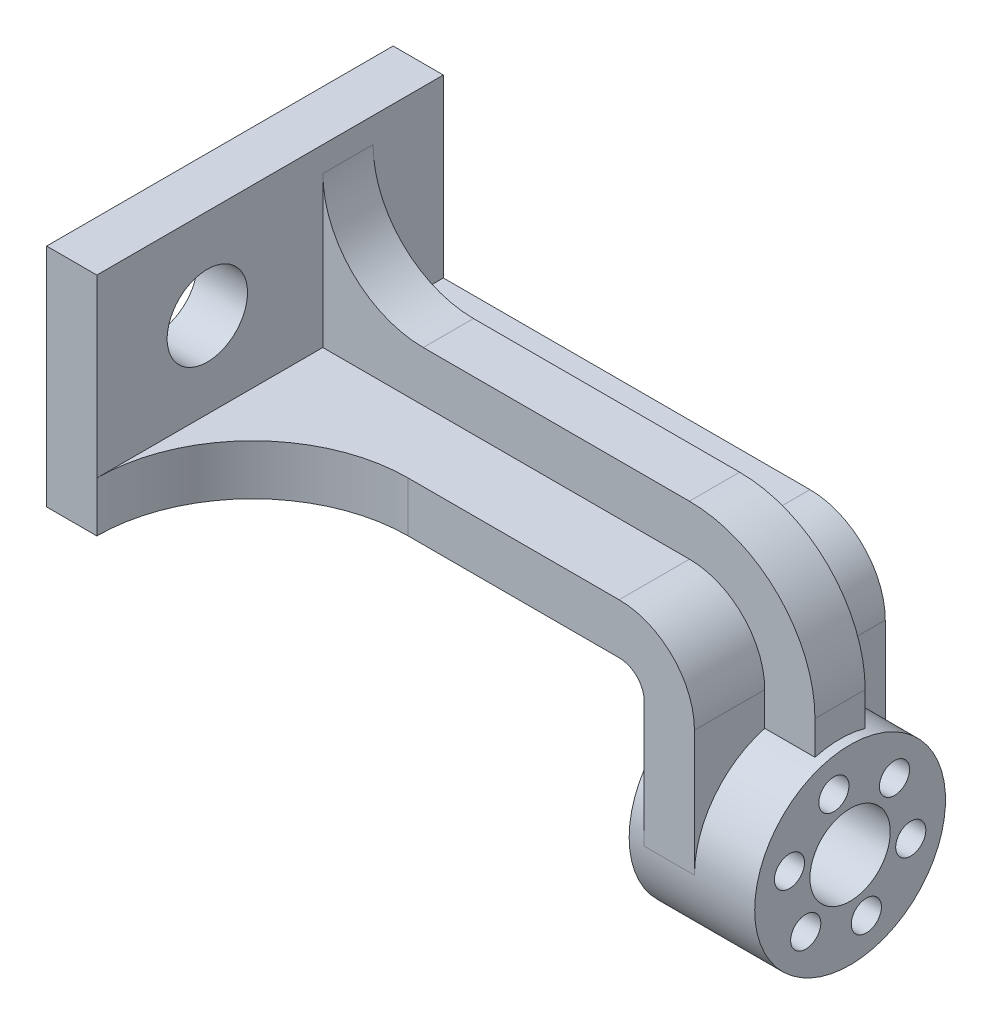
ISO-10303-21;
HEADER;
FILE_DESCRIPTION(('STEP AP214'),'2;1');
FILE_NAME('part.step','',(''),(''),'','','');
FILE_SCHEMA(('AUTOMOTIVE_DESIGN { 1 0 10303 214 1 1 1 1 }'));
ENDSEC;
DATA;
#1=APPLICATION_CONTEXT('core data for automotive mechanical design processes');
#2=APPLICATION_PROTOCOL_DEFINITION('international standard','automotive_design',2000,#1);
#3=PRODUCT_CONTEXT('',#1,'mechanical');
#4=PRODUCT('Part','Part','',(#3));
#5=PRODUCT_RELATED_PRODUCT_CATEGORY('part','',(#4));
#6=PRODUCT_DEFINITION_FORMATION('','',#4);
#7=PRODUCT_DEFINITION_CONTEXT('part definition',#1,'design');
#8=PRODUCT_DEFINITION('design','',#6,#7);
#9=PRODUCT_DEFINITION_SHAPE('','',#8);
#10=(LENGTH_UNIT() NAMED_UNIT(*) SI_UNIT(.MILLI.,.METRE.));
#11=(NAMED_UNIT(*) PLANE_ANGLE_UNIT() SI_UNIT($,.RADIAN.));
#12=(NAMED_UNIT(*) SI_UNIT($,.STERADIAN.) SOLID_ANGLE_UNIT());
#13=UNCERTAINTY_MEASURE_WITH_UNIT(LENGTH_MEASURE(1.E-05),#10,'distance_accuracy_value','');
#14=(GEOMETRIC_REPRESENTATION_CONTEXT(3) GLOBAL_UNCERTAINTY_ASSIGNED_CONTEXT((#13)) GLOBAL_UNIT_ASSIGNED_CONTEXT((#10,
#11,#12)) REPRESENTATION_CONTEXT('',''));
#15=CARTESIAN_POINT('',(0.,0.,0.));
#16=DIRECTION('',(0.,0.,1.));
#17=DIRECTION('',(1.,0.,0.));
#18=AXIS2_PLACEMENT_3D('',#15,#16,#17);
#19=CARTESIAN_POINT('',(41.,10.,34.5));
#20=DIRECTION('',(0.,-1.,0.));
#21=DIRECTION('',(0.,0.,-1.));
#22=AXIS2_PLACEMENT_3D('',#19,#20,#21);
#23=PLANE('',#22);
#24=DIRECTION('',(1.,0.,0.));
#25=VECTOR('',#24,1.);
#26=CARTESIAN_POINT('',(85.,10.,3.5));
#27=LINE('',#26,#25);
#28=CARTESIAN_POINT('',(41.,10.,3.49999999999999));
#29=VERTEX_POINT('',#28);
#30=CARTESIAN_POINT('',(83.,10.,3.5));
#31=VERTEX_POINT('',#30);
#32=EDGE_CURVE('E301',#29,#31,#27,.T.);
#33=ORIENTED_EDGE('',*,*,#32,.T.);
#34=DIRECTION('',(0.,0.,1.));
#35=VECTOR('',#34,1.);
#36=CARTESIAN_POINT('',(83.,10.,34.5));
#37=LINE('',#36,#35);
#38=CARTESIAN_POINT('',(83.,10.,-10.5));
#39=VERTEX_POINT('',#38);
#40=EDGE_CURVE('E194',#31,#39,#37,.F.);
#41=ORIENTED_EDGE('',*,*,#40,.T.);
#42=DIRECTION('',(1.,0.,0.));
#43=VECTOR('',#42,1.);
#44=CARTESIAN_POINT('',(41.,10.,-10.5));
#45=LINE('',#44,#43);
#46=CARTESIAN_POINT('',(10.,10.,-10.5));
#47=VERTEX_POINT('',#46);
#48=EDGE_CURVE('E191',#47,#39,#45,.T.);
#49=ORIENTED_EDGE('',*,*,#48,.F.);
#50=DIRECTION('',(0.,0.,-1.));
#51=VECTOR('',#50,1.);
#52=CARTESIAN_POINT('',(10.,10.,-34.5));
#53=LINE('',#52,#51);
#54=CARTESIAN_POINT('',(10.,10.,34.5));
#55=VERTEX_POINT('',#54);
#56=EDGE_CURVE('E174',#55,#47,#53,.T.);
#57=ORIENTED_EDGE('',*,*,#56,.F.);
#58=CARTESIAN_POINT('',(41.,10.,34.5));
#59=DIRECTION('',(0.,-1.,0.));
#60=DIRECTION('',(0.,0.,-1.));
#61=AXIS2_PLACEMENT_3D('',#58,#59,#60);
#62=CIRCLE('',#61,31.);
#63=EDGE_CURVE('E305',#55,#29,#62,.T.);
#64=ORIENTED_EDGE('',*,*,#63,.T.);
#65=EDGE_LOOP('',(#33,#41,#49,#57,#64));
#66=FACE_BOUND('',#65,.T.);
#67=ADVANCED_FACE('F37',(#66),#23,.F.);
#68=CARTESIAN_POINT('',(98.,-30.,-15.5));
#69=DIRECTION('',(-1.,0.,0.));
#70=DIRECTION('',(0.,0.,1.));
#71=AXIS2_PLACEMENT_3D('',#68,#69,#70);
#72=PLANE('',#71);
#73=DIRECTION('',(0.,-1.,0.));
#74=VECTOR('',#73,1.);
#75=CARTESIAN_POINT('',(98.,-30.,-10.5));
#76=LINE('',#75,#74);
#77=CARTESIAN_POINT('',(98.,-4.99999999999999,-10.5));
#78=VERTEX_POINT('',#77);
#79=CARTESIAN_POINT('',(98.,-11.6696972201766,-10.5));
#80=VERTEX_POINT('',#79);
#81=EDGE_CURVE('E197',#78,#80,#76,.T.);
#82=ORIENTED_EDGE('',*,*,#81,.F.);
#83=DIRECTION('',(0.,0.,1.));
#84=VECTOR('',#83,1.);
#85=CARTESIAN_POINT('',(98.,-4.99999999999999,-15.5));
#86=LINE('',#85,#84);
#87=CARTESIAN_POINT('',(98.,-4.99999999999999,3.49999999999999));
#88=VERTEX_POINT('',#87);
#89=EDGE_CURVE('E321',#78,#88,#86,.T.);
#90=ORIENTED_EDGE('',*,*,#89,.T.);
#91=DIRECTION('',(0.,-1.,0.));
#92=VECTOR('',#91,1.);
#93=CARTESIAN_POINT('',(98.,10.,3.49999999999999));
#94=LINE('',#93,#92);
#95=CARTESIAN_POINT('',(98.,-30.,3.49999999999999));
#96=VERTEX_POINT('',#95);
#97=EDGE_CURVE('E287',#88,#96,#94,.T.);
#98=ORIENTED_EDGE('',*,*,#97,.T.);
#99=CARTESIAN_POINT('',(98.,-30.,-15.5));
#100=DIRECTION('',(-1.,0.,0.));
#101=DIRECTION('',(0.,0.,1.));
#102=AXIS2_PLACEMENT_3D('',#99,#100,#101);
#103=CIRCLE('',#102,19.);
#104=EDGE_CURVE('E281',#96,#80,#103,.T.);
#105=ORIENTED_EDGE('',*,*,#104,.T.);
#106=EDGE_LOOP('',(#82,#90,#98,#105));
#107=FACE_BOUND('',#106,.T.);
#108=ADVANCED_FACE('F395',(#107),#72,.F.);
#109=DIRECTION('',(1.,0.,0.));
#110=VECTOR('',#109,1.);
#111=CARTESIAN_POINT('',(41.,10.,-20.5));
#112=LINE('',#111,#110);
#113=CARTESIAN_POINT('',(10.,10.,-20.5));
#114=VERTEX_POINT('',#113);
#115=CARTESIAN_POINT('',(83.,10.,-20.5));
#116=VERTEX_POINT('',#115);
#117=EDGE_CURVE('E363',#114,#116,#112,.T.);
#118=ORIENTED_EDGE('',*,*,#117,.T.);
#119=DIRECTION('',(0.,0.,1.));
#120=VECTOR('',#119,1.);
#121=CARTESIAN_POINT('',(83.,10.,34.5));
#122=LINE('',#121,#120);
#123=CARTESIAN_POINT('',(83.,10.,-34.5));
#124=VERTEX_POINT('',#123);
#125=EDGE_CURVE('E330',#116,#124,#122,.F.);
#126=ORIENTED_EDGE('',*,*,#125,.T.);
#127=DIRECTION('',(1.,0.,0.));
#128=VECTOR('',#127,1.);
#129=CARTESIAN_POINT('',(85.,10.,-34.5));
#130=LINE('',#129,#128);
#131=CARTESIAN_POINT('',(10.,10.,-34.5));
#132=VERTEX_POINT('',#131);
#133=EDGE_CURVE('E302',#132,#124,#130,.T.);
#134=ORIENTED_EDGE('',*,*,#133,.F.);
#135=EDGE_CURVE('E188',#114,#132,#53,.T.);
#136=ORIENTED_EDGE('',*,*,#135,.F.);
#137=EDGE_LOOP('',(#118,#126,#134,#136));
#138=FACE_BOUND('',#137,.T.);
#139=ADVANCED_FACE('F413',(#138),#23,.F.);
#140=CARTESIAN_POINT('',(41.,0.,34.5));
#141=DIRECTION('',(0.,1.,0.));
#142=DIRECTION('',(0.,0.,1.));
#143=AXIS2_PLACEMENT_3D('',#140,#141,#142);
#144=CYLINDRICAL_SURFACE('',#143,31.);
#145=CARTESIAN_POINT('',(41.,0.,34.5));
#146=DIRECTION('',(0.,1.,0.));
#147=DIRECTION('',(0.,0.,1.));
#148=AXIS2_PLACEMENT_3D('',#145,#146,#147);
#149=CIRCLE('',#148,31.);
#150=CARTESIAN_POINT('',(41.,0.,3.49999999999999));
#151=VERTEX_POINT('',#150);
#152=CARTESIAN_POINT('',(10.,0.,34.5));
#153=VERTEX_POINT('',#152);
#154=EDGE_CURVE('E277',#151,#153,#149,.T.);
#155=ORIENTED_EDGE('',*,*,#154,.F.);
#156=DIRECTION('',(0.,1.,0.));
#157=VECTOR('',#156,1.);
#158=CARTESIAN_POINT('',(41.,0.,3.49999999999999));
#159=LINE('',#158,#157);
#160=EDGE_CURVE('E308',#151,#29,#159,.T.);
#161=ORIENTED_EDGE('',*,*,#160,.T.);
#162=ORIENTED_EDGE('',*,*,#63,.F.);
#163=DIRECTION('',(0.,1.,0.));
#164=VECTOR('',#163,1.);
#165=CARTESIAN_POINT('',(10.,0.,34.5));
#166=LINE('',#165,#164);
#167=EDGE_CURVE('E309',#153,#55,#166,.T.);
#168=ORIENTED_EDGE('',*,*,#167,.F.);
#169=EDGE_LOOP('',(#155,#161,#162,#168));
#170=FACE_BOUND('',#169,.T.);
#171=ADVANCED_FACE('F434',(#170),#144,.F.);
#172=CARTESIAN_POINT('',(10.,-30.,-34.5));
#173=DIRECTION('',(0.,0.,-1.));
#174=DIRECTION('',(-1.,0.,0.));
#175=AXIS2_PLACEMENT_3D('',#172,#173,#174);
#176=PLANE('',#175);
#177=ORIENTED_EDGE('',*,*,#133,.T.);
#178=CARTESIAN_POINT('',(83.,-4.99999999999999,-34.5));
#179=DIRECTION('',(0.,0.,-1.));
#180=DIRECTION('',(-1.,0.,0.));
#181=AXIS2_PLACEMENT_3D('',#178,#179,#180);
#182=CIRCLE('',#181,15.);
#183=CARTESIAN_POINT('',(98.,-4.99999999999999,-34.5));
#184=VERTEX_POINT('',#183);
#185=EDGE_CURVE('E332',#124,#184,#182,.T.);
#186=ORIENTED_EDGE('',*,*,#185,.T.);
#187=DIRECTION('',(0.,1.,0.));
#188=VECTOR('',#187,1.);
#189=CARTESIAN_POINT('',(98.,-30.,-34.5));
#190=LINE('',#189,#188);
#191=CARTESIAN_POINT('',(98.,-30.,-34.5));
#192=VERTEX_POINT('',#191);
#193=EDGE_CURVE('E284',#192,#184,#190,.T.);
#194=ORIENTED_EDGE('',*,*,#193,.F.);
#195=DIRECTION('',(-1.,0.,0.));
#196=VECTOR('',#195,1.);
#197=CARTESIAN_POINT('',(110.,-30.,-34.5));
#198=LINE('',#197,#196);
#199=CARTESIAN_POINT('',(88.,-30.,-34.5));
#200=VERTEX_POINT('',#199);
#201=EDGE_CURVE('E298',#192,#200,#198,.T.);
#202=ORIENTED_EDGE('',*,*,#201,.T.);
#203=DIRECTION('',(0.,-1.,0.));
#204=VECTOR('',#203,1.);
#205=CARTESIAN_POINT('',(88.,0.,-34.5));
#206=LINE('',#205,#204);
#207=CARTESIAN_POINT('',(88.,-5.,-34.5));
#208=VERTEX_POINT('',#207);
#209=EDGE_CURVE('E270',#208,#200,#206,.T.);
#210=ORIENTED_EDGE('',*,*,#209,.F.);
#211=CARTESIAN_POINT('',(83.,-5.,-34.5));
#212=DIRECTION('',(0.,0.,-1.));
#213=DIRECTION('',(-1.,0.,0.));
#214=AXIS2_PLACEMENT_3D('',#211,#212,#213);
#215=CIRCLE('',#214,5.);
#216=CARTESIAN_POINT('',(83.,0.,-34.5));
#217=VERTEX_POINT('',#216);
#218=EDGE_CURVE('E317',#208,#217,#215,.F.);
#219=ORIENTED_EDGE('',*,*,#218,.T.);
#220=DIRECTION('',(1.,0.,0.));
#221=VECTOR('',#220,1.);
#222=CARTESIAN_POINT('',(10.,0.,-34.5));
#223=LINE('',#222,#221);
#224=CARTESIAN_POINT('',(0.,0.,-34.5));
#225=VERTEX_POINT('',#224);
#226=EDGE_CURVE('E272',#225,#217,#223,.T.);
#227=ORIENTED_EDGE('',*,*,#226,.F.);
#228=DIRECTION('',(0.,-1.,0.));
#229=VECTOR('',#228,1.);
#230=CARTESIAN_POINT('',(0.,0.,-34.5));
#231=LINE('',#230,#229);
#232=CARTESIAN_POINT('',(0.,45.,-34.5));
#233=VERTEX_POINT('',#232);
#234=EDGE_CURVE('E256',#233,#225,#231,.T.);
#235=ORIENTED_EDGE('',*,*,#234,.F.);
#236=DIRECTION('',(-1.,0.,0.));
#237=VECTOR('',#236,1.);
#238=CARTESIAN_POINT('',(0.,45.,-34.5));
#239=LINE('',#238,#237);
#240=CARTESIAN_POINT('',(10.,45.,-34.5));
#241=VERTEX_POINT('',#240);
#242=EDGE_CURVE('E244',#241,#233,#239,.T.);
#243=ORIENTED_EDGE('',*,*,#242,.F.);
#244=DIRECTION('',(0.,-1.,0.));
#245=VECTOR('',#244,1.);
#246=CARTESIAN_POINT('',(10.,45.,-34.5));
#247=LINE('',#246,#245);
#248=EDGE_CURVE('E253',#241,#132,#247,.T.);
#249=ORIENTED_EDGE('',*,*,#248,.T.);
#250=EDGE_LOOP('',(#177,#186,#194,#202,#210,#219,#227,#235,#243,#249));
#251=FACE_BOUND('',#250,.T.);
#252=ADVANCED_FACE('F405',(#251),#176,.T.);
#253=CARTESIAN_POINT('',(10.,-30.,3.49999999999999));
#254=DIRECTION('',(0.,0.,-1.));
#255=DIRECTION('',(-1.,0.,0.));
#256=AXIS2_PLACEMENT_3D('',#253,#254,#255);
#257=PLANE('',#256);
#258=ORIENTED_EDGE('',*,*,#97,.F.);
#259=CARTESIAN_POINT('',(83.,-4.99999999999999,3.5));
#260=DIRECTION('',(0.,0.,-1.));
#261=DIRECTION('',(-1.,0.,0.));
#262=AXIS2_PLACEMENT_3D('',#259,#260,#261);
#263=CIRCLE('',#262,15.);
#264=EDGE_CURVE('E324',#88,#31,#263,.F.);
#265=ORIENTED_EDGE('',*,*,#264,.T.);
#266=ORIENTED_EDGE('',*,*,#32,.F.);
#267=ORIENTED_EDGE('',*,*,#160,.F.);
#268=DIRECTION('',(-1.,0.,0.));
#269=VECTOR('',#268,1.);
#270=CARTESIAN_POINT('',(85.,0.,3.49999999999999));
#271=LINE('',#270,#269);
#272=CARTESIAN_POINT('',(83.,0.,3.49999999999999));
#273=VERTEX_POINT('',#272);
#274=EDGE_CURVE('E275',#273,#151,#271,.T.);
#275=ORIENTED_EDGE('',*,*,#274,.F.);
#276=CARTESIAN_POINT('',(83.,-5.,3.5));
#277=DIRECTION('',(0.,0.,-1.));
#278=DIRECTION('',(-1.,0.,0.));
#279=AXIS2_PLACEMENT_3D('',#276,#277,#278);
#280=CIRCLE('',#279,5.);
#281=CARTESIAN_POINT('',(88.,-5.,3.5));
#282=VERTEX_POINT('',#281);
#283=EDGE_CURVE('E319',#273,#282,#280,.T.);
#284=ORIENTED_EDGE('',*,*,#283,.T.);
#285=DIRECTION('',(0.,1.,0.));
#286=VECTOR('',#285,1.);
#287=CARTESIAN_POINT('',(88.,-30.,3.5));
#288=LINE('',#287,#286);
#289=CARTESIAN_POINT('',(88.,-30.,3.5));
#290=VERTEX_POINT('',#289);
#291=EDGE_CURVE('E267',#290,#282,#288,.T.);
#292=ORIENTED_EDGE('',*,*,#291,.F.);
#293=DIRECTION('',(-1.,0.,0.));
#294=VECTOR('',#293,1.);
#295=CARTESIAN_POINT('',(110.,-30.,3.5));
#296=LINE('',#295,#294);
#297=EDGE_CURVE('E293',#96,#290,#296,.T.);
#298=ORIENTED_EDGE('',*,*,#297,.F.);
#299=EDGE_LOOP('',(#258,#265,#266,#267,#275,#284,#292,#298));
#300=FACE_BOUND('',#299,.T.);
#301=ADVANCED_FACE('F399',(#300),#257,.F.);
#302=CARTESIAN_POINT('',(85.,-30.,-15.5));
#303=DIRECTION('',(-1.,0.,0.));
#304=DIRECTION('',(0.,0.,1.));
#305=AXIS2_PLACEMENT_3D('',#302,#303,#304);
#306=PLANE('',#305);
#307=CARTESIAN_POINT('',(85.,-30.,-15.5));
#308=DIRECTION('',(-1.,0.,0.));
#309=DIRECTION('',(0.,0.,1.));
#310=AXIS2_PLACEMENT_3D('',#307,#308,#309);
#311=CIRCLE('',#310,7.99999999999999);
#312=CARTESIAN_POINT('',(85.,-30.,-7.50000000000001));
#313=VERTEX_POINT('',#312);
#314=EDGE_CURVE('E716',#313,#313,#311,.T.);
#315=ORIENTED_EDGE('',*,*,#314,.F.);
#316=EDGE_LOOP('',(#315));
#317=FACE_BOUND('',#316,.T.);
#318=CARTESIAN_POINT('',(85.,-42.0740728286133,-18.7352380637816));
#319=DIRECTION('',(-1.,0.,0.));
#320=DIRECTION('',(0.,0.,1.));
#321=AXIS2_PLACEMENT_3D('',#318,#319,#320);
#322=CIRCLE('',#321,2.99999999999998);
#323=CARTESIAN_POINT('',(85.,-42.0740728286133,-15.7352380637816));
#324=VERTEX_POINT('',#323);
#325=EDGE_CURVE('E219',#324,#324,#322,.T.);
#326=ORIENTED_EDGE('',*,*,#325,.F.);
#327=EDGE_LOOP('',(#326));
#328=FACE_BOUND('',#327,.T.);
#329=CARTESIAN_POINT('',(85.,-30.,-15.5));
#330=DIRECTION('',(1.,0.,0.));
#331=DIRECTION('',(0.,0.,1.));
#332=AXIS2_PLACEMENT_3D('',#329,#330,#331);
#333=CIRCLE('',#332,19.);
#334=CARTESIAN_POINT('',(85.,-30.,3.5));
#335=VERTEX_POINT('',#334);
#336=EDGE_CURVE('E289',#335,#335,#333,.T.);
#337=ORIENTED_EDGE('',*,*,#336,.F.);
#338=EDGE_LOOP('',(#337));
#339=FACE_BOUND('',#338,.T.);
#340=CARTESIAN_POINT('',(85.,-33.2352380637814,-27.5740728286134));
#341=DIRECTION('',(-1.,0.,0.));
#342=DIRECTION('',(0.,0.,1.));
#343=AXIS2_PLACEMENT_3D('',#340,#341,#342);
#344=CIRCLE('',#343,2.99999999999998);
#345=CARTESIAN_POINT('',(85.,-33.2352380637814,-24.5740728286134));
#346=VERTEX_POINT('',#345);
#347=EDGE_CURVE('E213',#346,#346,#344,.T.);
#348=ORIENTED_EDGE('',*,*,#347,.F.);
#349=EDGE_LOOP('',(#348));
#350=FACE_BOUND('',#349,.T.);
#351=CARTESIAN_POINT('',(85.,-21.1611652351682,-24.3388347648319));
#352=DIRECTION('',(-1.,0.,0.));
#353=DIRECTION('',(0.,0.,1.));
#354=AXIS2_PLACEMENT_3D('',#351,#352,#353);
#355=CIRCLE('',#354,2.99999999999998);
#356=CARTESIAN_POINT('',(85.,-21.1611652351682,-21.3388347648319));
#357=VERTEX_POINT('',#356);
#358=EDGE_CURVE('E711',#357,#357,#355,.T.);
#359=ORIENTED_EDGE('',*,*,#358,.F.);
#360=EDGE_LOOP('',(#359));
#361=FACE_BOUND('',#360,.T.);
#362=CARTESIAN_POINT('',(85.,-17.9259271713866,-12.2647619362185));
#363=DIRECTION('',(-1.,0.,0.));
#364=DIRECTION('',(0.,0.,1.));
#365=AXIS2_PLACEMENT_3D('',#362,#363,#364);
#366=CIRCLE('',#365,2.99999999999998);
#367=CARTESIAN_POINT('',(85.,-17.9259271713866,-9.26476193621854));
#368=VERTEX_POINT('',#367);
#369=EDGE_CURVE('E705',#368,#368,#366,.T.);
#370=ORIENTED_EDGE('',*,*,#369,.F.);
#371=EDGE_LOOP('',(#370));
#372=FACE_BOUND('',#371,.T.);
#373=CARTESIAN_POINT('',(85.,-26.7647619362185,-3.42592717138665));
#374=DIRECTION('',(-1.,0.,0.));
#375=DIRECTION('',(0.,0.,1.));
#376=AXIS2_PLACEMENT_3D('',#373,#374,#375);
#377=CIRCLE('',#376,2.99999999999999);
#378=CARTESIAN_POINT('',(85.,-26.7647619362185,-0.42592717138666));
#379=VERTEX_POINT('',#378);
#380=EDGE_CURVE('E697',#379,#379,#377,.T.);
#381=ORIENTED_EDGE('',*,*,#380,.F.);
#382=EDGE_LOOP('',(#381));
#383=FACE_BOUND('',#382,.T.);
#384=CARTESIAN_POINT('',(85.,-38.8388347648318,-6.66116523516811));
#385=DIRECTION('',(-1.,0.,0.));
#386=DIRECTION('',(0.,0.,1.));
#387=AXIS2_PLACEMENT_3D('',#384,#385,#386);
#388=CIRCLE('',#387,2.99999999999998);
#389=CARTESIAN_POINT('',(85.,-38.8388347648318,-3.66116523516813));
#390=VERTEX_POINT('',#389);
#391=EDGE_CURVE('E226',#390,#390,#388,.T.);
#392=ORIENTED_EDGE('',*,*,#391,.F.);
#393=EDGE_LOOP('',(#392));
#394=FACE_BOUND('',#393,.T.);
#395=ADVANCED_FACE('F565',(#317,#328,#339,#350,#361,#372,#383,#394),#306,.T.);
#396=CARTESIAN_POINT('',(110.,-30.,-15.5));
#397=DIRECTION('',(-1.,0.,0.));
#398=DIRECTION('',(0.,0.,1.));
#399=AXIS2_PLACEMENT_3D('',#396,#397,#398);
#400=CYLINDRICAL_SURFACE('',#399,19.);
#401=ORIENTED_EDGE('',*,*,#336,.T.);
#402=EDGE_LOOP('',(#401));
#403=FACE_BOUND('',#402,.T.);
#404=ORIENTED_EDGE('',*,*,#297,.T.);
#405=CARTESIAN_POINT('',(88.,-30.,-15.5));
#406=DIRECTION('',(1.,0.,0.));
#407=DIRECTION('',(0.,0.,-1.));
#408=AXIS2_PLACEMENT_3D('',#405,#406,#407);
#409=CIRCLE('',#408,19.);
#410=EDGE_CURVE('E265',#200,#290,#409,.T.);
#411=ORIENTED_EDGE('',*,*,#410,.F.);
#412=ORIENTED_EDGE('',*,*,#201,.F.);
#413=CARTESIAN_POINT('',(98.,-11.6696972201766,-20.5));
#414=VERTEX_POINT('',#413);
#415=EDGE_CURVE('E280',#414,#192,#103,.T.);
#416=ORIENTED_EDGE('',*,*,#415,.F.);
#417=DIRECTION('',(-1.,0.,0.));
#418=VECTOR('',#417,1.);
#419=CARTESIAN_POINT('',(110.,-11.6696972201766,-20.5));
#420=LINE('',#419,#418);
#421=CARTESIAN_POINT('',(108.,-11.6696972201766,-20.5));
#422=VERTEX_POINT('',#421);
#423=EDGE_CURVE('E207',#414,#422,#420,.F.);
#424=ORIENTED_EDGE('',*,*,#423,.T.);
#425=CARTESIAN_POINT('',(108.,-30.,-15.5));
#426=DIRECTION('',(1.,0.,0.));
#427=DIRECTION('',(0.,1.,0.));
#428=AXIS2_PLACEMENT_3D('',#425,#426,#427);
#429=CIRCLE('',#428,19.);
#430=CARTESIAN_POINT('',(108.,-11.6696972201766,-10.5));
#431=VERTEX_POINT('',#430);
#432=EDGE_CURVE('E204',#422,#431,#429,.T.);
#433=ORIENTED_EDGE('',*,*,#432,.T.);
#434=DIRECTION('',(-1.,0.,0.));
#435=VECTOR('',#434,1.);
#436=CARTESIAN_POINT('',(110.,-11.6696972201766,-10.5));
#437=LINE('',#436,#435);
#438=EDGE_CURVE('E210',#80,#431,#437,.F.);
#439=ORIENTED_EDGE('',*,*,#438,.F.);
#440=ORIENTED_EDGE('',*,*,#104,.F.);
#441=EDGE_LOOP('',(#404,#411,#412,#416,#424,#433,#439,#440));
#442=FACE_BOUND('',#441,.T.);
#443=CARTESIAN_POINT('',(110.,-30.,-15.5));
#444=DIRECTION('',(1.,0.,0.));
#445=DIRECTION('',(0.,0.,1.));
#446=AXIS2_PLACEMENT_3D('',#443,#444,#445);
#447=CIRCLE('',#446,19.);
#448=CARTESIAN_POINT('',(110.,-30.,3.5));
#449=VERTEX_POINT('',#448);
#450=EDGE_CURVE('E290',#449,#449,#447,.T.);
#451=ORIENTED_EDGE('',*,*,#450,.F.);
#452=EDGE_LOOP('',(#451));
#453=FACE_BOUND('',#452,.T.);
#454=ADVANCED_FACE('F384',(#403,#442,#453),#400,.T.);
#455=CARTESIAN_POINT('',(110.,-30.,-15.5));
#456=DIRECTION('',(-1.,0.,0.));
#457=DIRECTION('',(0.,0.,1.));
#458=AXIS2_PLACEMENT_3D('',#455,#456,#457);
#459=PLANE('',#458);
#460=CARTESIAN_POINT('',(110.,-33.2352380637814,-27.5740728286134));
#461=DIRECTION('',(-1.,0.,0.));
#462=DIRECTION('',(0.,0.,1.));
#463=AXIS2_PLACEMENT_3D('',#460,#461,#462);
#464=CIRCLE('',#463,2.99999999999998);
#465=CARTESIAN_POINT('',(110.,-33.2352380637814,-24.5740728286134));
#466=VERTEX_POINT('',#465);
#467=EDGE_CURVE('E216',#466,#466,#464,.T.);
#468=ORIENTED_EDGE('',*,*,#467,.T.);
#469=EDGE_LOOP('',(#468));
#470=FACE_BOUND('',#469,.T.);
#471=CARTESIAN_POINT('',(110.,-42.0740728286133,-18.7352380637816));
#472=DIRECTION('',(-1.,0.,0.));
#473=DIRECTION('',(0.,0.,1.));
#474=AXIS2_PLACEMENT_3D('',#471,#472,#473);
#475=CIRCLE('',#474,2.99999999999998);
#476=CARTESIAN_POINT('',(110.,-42.0740728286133,-15.7352380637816));
#477=VERTEX_POINT('',#476);
#478=EDGE_CURVE('E222',#477,#477,#475,.T.);
#479=ORIENTED_EDGE('',*,*,#478,.T.);
#480=EDGE_LOOP('',(#479));
#481=FACE_BOUND('',#480,.T.);
#482=CARTESIAN_POINT('',(110.,-38.8388347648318,-6.66116523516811));
#483=DIRECTION('',(-1.,0.,0.));
#484=DIRECTION('',(0.,0.,1.));
#485=AXIS2_PLACEMENT_3D('',#482,#483,#484);
#486=CIRCLE('',#485,2.99999999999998);
#487=CARTESIAN_POINT('',(110.,-38.8388347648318,-3.66116523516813));
#488=VERTEX_POINT('',#487);
#489=EDGE_CURVE('E693',#488,#488,#486,.T.);
#490=ORIENTED_EDGE('',*,*,#489,.T.);
#491=EDGE_LOOP('',(#490));
#492=FACE_BOUND('',#491,.T.);
#493=CARTESIAN_POINT('',(110.,-26.7647619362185,-3.42592717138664));
#494=DIRECTION('',(-1.,0.,0.));
#495=DIRECTION('',(0.,0.,1.));
#496=AXIS2_PLACEMENT_3D('',#493,#494,#495);
#497=CIRCLE('',#496,2.99999999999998);
#498=CARTESIAN_POINT('',(110.,-26.7647619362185,-0.42592717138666));
#499=VERTEX_POINT('',#498);
#500=EDGE_CURVE('E700',#499,#499,#497,.T.);
#501=ORIENTED_EDGE('',*,*,#500,.T.);
#502=EDGE_LOOP('',(#501));
#503=FACE_BOUND('',#502,.T.);
#504=CARTESIAN_POINT('',(110.,-17.9259271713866,-12.2647619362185));
#505=DIRECTION('',(-1.,0.,0.));
#506=DIRECTION('',(0.,0.,1.));
#507=AXIS2_PLACEMENT_3D('',#504,#505,#506);
#508=CIRCLE('',#507,2.99999999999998);
#509=CARTESIAN_POINT('',(110.,-17.9259271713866,-9.26476193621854));
#510=VERTEX_POINT('',#509);
#511=EDGE_CURVE('E707',#510,#510,#508,.T.);
#512=ORIENTED_EDGE('',*,*,#511,.T.);
#513=EDGE_LOOP('',(#512));
#514=FACE_BOUND('',#513,.T.);
#515=CARTESIAN_POINT('',(110.,-21.1611652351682,-24.3388347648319));
#516=DIRECTION('',(-1.,0.,0.));
#517=DIRECTION('',(0.,0.,1.));
#518=AXIS2_PLACEMENT_3D('',#515,#516,#517);
#519=CIRCLE('',#518,2.99999999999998);
#520=CARTESIAN_POINT('',(110.,-21.1611652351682,-21.3388347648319));
#521=VERTEX_POINT('',#520);
#522=EDGE_CURVE('E714',#521,#521,#519,.T.);
#523=ORIENTED_EDGE('',*,*,#522,.T.);
#524=EDGE_LOOP('',(#523));
#525=FACE_BOUND('',#524,.T.);
#526=CARTESIAN_POINT('',(110.,-30.,-15.5));
#527=DIRECTION('',(-1.,0.,0.));
#528=DIRECTION('',(0.,0.,1.));
#529=AXIS2_PLACEMENT_3D('',#526,#527,#528);
#530=CIRCLE('',#529,7.99999999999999);
#531=CARTESIAN_POINT('',(110.,-30.,-7.50000000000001));
#532=VERTEX_POINT('',#531);
#533=EDGE_CURVE('E237',#532,#532,#530,.T.);
#534=ORIENTED_EDGE('',*,*,#533,.T.);
#535=EDGE_LOOP('',(#534));
#536=FACE_BOUND('',#535,.T.);
#537=ORIENTED_EDGE('',*,*,#450,.T.);
#538=EDGE_LOOP('',(#537));
#539=FACE_BOUND('',#538,.T.);
#540=ADVANCED_FACE('F577',(#470,#481,#492,#503,#514,#525,#536,#539),#459,.F.);
#541=ORIENTED_EDGE('',*,*,#193,.T.);
#542=DIRECTION('',(0.,0.,1.));
#543=VECTOR('',#542,1.);
#544=CARTESIAN_POINT('',(98.,-4.99999999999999,-15.5));
#545=LINE('',#544,#543);
#546=CARTESIAN_POINT('',(98.,-4.99999999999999,-20.5));
#547=VERTEX_POINT('',#546);
#548=EDGE_CURVE('E327',#184,#547,#545,.T.);
#549=ORIENTED_EDGE('',*,*,#548,.T.);
#550=DIRECTION('',(0.,-1.,0.));
#551=VECTOR('',#550,1.);
#552=CARTESIAN_POINT('',(98.,-30.,-20.5));
#553=LINE('',#552,#551);
#554=EDGE_CURVE('E371',#547,#414,#553,.T.);
#555=ORIENTED_EDGE('',*,*,#554,.T.);
#556=ORIENTED_EDGE('',*,*,#415,.T.);
#557=EDGE_LOOP('',(#541,#549,#555,#556));
#558=FACE_BOUND('',#557,.T.);
#559=ADVANCED_FACE('F378',(#558),#72,.F.);
#560=CARTESIAN_POINT('',(41.,0.,34.5));
#561=DIRECTION('',(0.,1.,0.));
#562=DIRECTION('',(0.,0.,1.));
#563=AXIS2_PLACEMENT_3D('',#560,#561,#562);
#564=PLANE('',#563);
#565=ORIENTED_EDGE('',*,*,#226,.T.);
#566=DIRECTION('',(0.,0.,-1.));
#567=VECTOR('',#566,1.);
#568=CARTESIAN_POINT('',(83.,0.,3.5));
#569=LINE('',#568,#567);
#570=EDGE_CURVE('E315',#217,#273,#569,.F.);
#571=ORIENTED_EDGE('',*,*,#570,.T.);
#572=ORIENTED_EDGE('',*,*,#274,.T.);
#573=ORIENTED_EDGE('',*,*,#154,.T.);
#574=DIRECTION('',(1.,0.,0.));
#575=VECTOR('',#574,1.);
#576=CARTESIAN_POINT('',(0.,0.,34.5));
#577=LINE('',#576,#575);
#578=CARTESIAN_POINT('',(0.,0.,34.5));
#579=VERTEX_POINT('',#578);
#580=EDGE_CURVE('E263',#579,#153,#577,.T.);
#581=ORIENTED_EDGE('',*,*,#580,.F.);
#582=DIRECTION('',(0.,0.,1.));
#583=VECTOR('',#582,1.);
#584=CARTESIAN_POINT('',(0.,0.,34.5));
#585=LINE('',#584,#583);
#586=EDGE_CURVE('E259',#225,#579,#585,.T.);
#587=ORIENTED_EDGE('',*,*,#586,.F.);
#588=EDGE_LOOP('',(#565,#571,#572,#573,#581,#587));
#589=FACE_BOUND('',#588,.T.);
#590=ADVANCED_FACE('F576',(#589),#564,.F.);
#591=CARTESIAN_POINT('',(88.,-30.,-15.5));
#592=DIRECTION('',(1.,0.,0.));
#593=DIRECTION('',(0.,0.,-1.));
#594=AXIS2_PLACEMENT_3D('',#591,#592,#593);
#595=PLANE('',#594);
#596=ORIENTED_EDGE('',*,*,#291,.T.);
#597=DIRECTION('',(0.,0.,-1.));
#598=VECTOR('',#597,1.);
#599=CARTESIAN_POINT('',(88.,-5.,-34.5));
#600=LINE('',#599,#598);
#601=EDGE_CURVE('E311',#282,#208,#600,.T.);
#602=ORIENTED_EDGE('',*,*,#601,.T.);
#603=ORIENTED_EDGE('',*,*,#209,.T.);
#604=ORIENTED_EDGE('',*,*,#410,.T.);
#605=EDGE_LOOP('',(#596,#602,#603,#604));
#606=FACE_BOUND('',#605,.T.);
#607=ADVANCED_FACE('F531',(#606),#595,.F.);
#608=CARTESIAN_POINT('',(0.,10.,34.5));
#609=DIRECTION('',(0.,0.,-1.));
#610=DIRECTION('',(0.,1.,0.));
#611=AXIS2_PLACEMENT_3D('',#608,#609,#610);
#612=PLANE('',#611);
#613=ORIENTED_EDGE('',*,*,#167,.T.);
#614=DIRECTION('',(0.,-1.,0.));
#615=VECTOR('',#614,1.);
#616=CARTESIAN_POINT('',(10.,45.,34.5));
#617=LINE('',#616,#615);
#618=CARTESIAN_POINT('',(10.,45.,34.5));
#619=VERTEX_POINT('',#618);
#620=EDGE_CURVE('E183',#619,#55,#617,.T.);
#621=ORIENTED_EDGE('',*,*,#620,.F.);
#622=DIRECTION('',(1.,0.,0.));
#623=VECTOR('',#622,1.);
#624=CARTESIAN_POINT('',(10.,45.,34.5));
#625=LINE('',#624,#623);
#626=CARTESIAN_POINT('',(0.,45.,34.5));
#627=VERTEX_POINT('',#626);
#628=EDGE_CURVE('E250',#627,#619,#625,.T.);
#629=ORIENTED_EDGE('',*,*,#628,.F.);
#630=DIRECTION('',(0.,1.,0.));
#631=VECTOR('',#630,1.);
#632=CARTESIAN_POINT('',(0.,10.,34.5));
#633=LINE('',#632,#631);
#634=EDGE_CURVE('E261',#579,#627,#633,.T.);
#635=ORIENTED_EDGE('',*,*,#634,.F.);
#636=ORIENTED_EDGE('',*,*,#580,.T.);
#637=EDGE_LOOP('',(#613,#621,#629,#635,#636));
#638=FACE_BOUND('',#637,.T.);
#639=ADVANCED_FACE('F596',(#638),#612,.F.);
#640=CARTESIAN_POINT('',(0.,0.,0.));
#641=DIRECTION('',(1.,0.,0.));
#642=DIRECTION('',(0.,0.,-1.));
#643=AXIS2_PLACEMENT_3D('',#640,#641,#642);
#644=PLANE('',#643);
#645=CARTESIAN_POINT('',(0.,27.,12.5));
#646=DIRECTION('',(1.,0.,0.));
#647=DIRECTION('',(0.,0.,-1.));
#648=AXIS2_PLACEMENT_3D('',#645,#646,#647);
#649=CIRCLE('',#648,7.99999999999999);
#650=CARTESIAN_POINT('',(0.,27.,4.50000000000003));
#651=VERTEX_POINT('',#650);
#652=EDGE_CURVE('E236',#651,#651,#649,.T.);
#653=ORIENTED_EDGE('',*,*,#652,.T.);
#654=EDGE_LOOP('',(#653));
#655=FACE_BOUND('',#654,.T.);
#656=ORIENTED_EDGE('',*,*,#586,.T.);
#657=ORIENTED_EDGE('',*,*,#634,.T.);
#658=DIRECTION('',(0.,0.,1.));
#659=VECTOR('',#658,1.);
#660=CARTESIAN_POINT('',(0.,45.,34.5));
#661=LINE('',#660,#659);
#662=EDGE_CURVE('E247',#233,#627,#661,.T.);
#663=ORIENTED_EDGE('',*,*,#662,.F.);
#664=ORIENTED_EDGE('',*,*,#234,.T.);
#665=EDGE_LOOP('',(#656,#657,#663,#664));
#666=FACE_BOUND('',#665,.T.);
#667=ADVANCED_FACE('F471',(#655,#666),#644,.F.);
#668=CARTESIAN_POINT('',(10.,45.,-34.5));
#669=DIRECTION('',(-1.,0.,0.));
#670=DIRECTION('',(0.,0.,1.));
#671=AXIS2_PLACEMENT_3D('',#668,#669,#670);
#672=PLANE('',#671);
#673=CARTESIAN_POINT('',(10.,27.,12.5));
#674=DIRECTION('',(1.,0.,0.));
#675=DIRECTION('',(0.,0.,-1.));
#676=AXIS2_PLACEMENT_3D('',#673,#674,#675);
#677=CIRCLE('',#676,7.99999999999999);
#678=CARTESIAN_POINT('',(10.,27.,4.50000000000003));
#679=VERTEX_POINT('',#678);
#680=EDGE_CURVE('E232',#679,#679,#677,.T.);
#681=ORIENTED_EDGE('',*,*,#680,.F.);
#682=EDGE_LOOP('',(#681));
#683=FACE_BOUND('',#682,.T.);
#684=DIRECTION('',(0.,0.,-1.));
#685=VECTOR('',#684,1.);
#686=CARTESIAN_POINT('',(10.,40.,-34.5));
#687=LINE('',#686,#685);
#688=CARTESIAN_POINT('',(10.,40.,-10.5));
#689=VERTEX_POINT('',#688);
#690=CARTESIAN_POINT('',(10.,40.,-20.5));
#691=VERTEX_POINT('',#690);
#692=EDGE_CURVE('E338',#689,#691,#687,.T.);
#693=ORIENTED_EDGE('',*,*,#692,.T.);
#694=DIRECTION('',(0.,-1.,0.));
#695=VECTOR('',#694,1.);
#696=CARTESIAN_POINT('',(10.,45.,-20.5));
#697=LINE('',#696,#695);
#698=EDGE_CURVE('E360',#691,#114,#697,.T.);
#699=ORIENTED_EDGE('',*,*,#698,.T.);
#700=ORIENTED_EDGE('',*,*,#135,.T.);
#701=ORIENTED_EDGE('',*,*,#248,.F.);
#702=DIRECTION('',(0.,0.,-1.));
#703=VECTOR('',#702,1.);
#704=CARTESIAN_POINT('',(10.,45.,-34.5));
#705=LINE('',#704,#703);
#706=EDGE_CURVE('E187',#619,#241,#705,.T.);
#707=ORIENTED_EDGE('',*,*,#706,.F.);
#708=ORIENTED_EDGE('',*,*,#620,.T.);
#709=ORIENTED_EDGE('',*,*,#56,.T.);
#710=DIRECTION('',(0.,-1.,0.));
#711=VECTOR('',#710,1.);
#712=CARTESIAN_POINT('',(10.,45.,-10.5));
#713=LINE('',#712,#711);
#714=EDGE_CURVE('E179',#689,#47,#713,.T.);
#715=ORIENTED_EDGE('',*,*,#714,.F.);
#716=EDGE_LOOP('',(#693,#699,#700,#701,#707,#708,#709,#715));
#717=FACE_BOUND('',#716,.T.);
#718=ADVANCED_FACE('F177',(#683,#717),#672,.F.);
#719=CARTESIAN_POINT('',(0.,45.,0.));
#720=DIRECTION('',(0.,-1.,0.));
#721=DIRECTION('',(0.,0.,-1.));
#722=AXIS2_PLACEMENT_3D('',#719,#720,#721);
#723=PLANE('',#722);
#724=ORIENTED_EDGE('',*,*,#706,.T.);
#725=ORIENTED_EDGE('',*,*,#242,.T.);
#726=ORIENTED_EDGE('',*,*,#662,.T.);
#727=ORIENTED_EDGE('',*,*,#628,.T.);
#728=EDGE_LOOP('',(#724,#725,#726,#727));
#729=FACE_BOUND('',#728,.T.);
#730=ADVANCED_FACE('F470',(#729),#723,.F.);
#731=CARTESIAN_POINT('',(10.,27.,12.5));
#732=DIRECTION('',(1.,0.,0.));
#733=DIRECTION('',(0.,0.,-1.));
#734=AXIS2_PLACEMENT_3D('',#731,#732,#733);
#735=CYLINDRICAL_SURFACE('',#734,7.99999999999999);
#736=ORIENTED_EDGE('',*,*,#652,.F.);
#737=EDGE_LOOP('',(#736));
#738=FACE_BOUND('',#737,.T.);
#739=ORIENTED_EDGE('',*,*,#680,.T.);
#740=EDGE_LOOP('',(#739));
#741=FACE_BOUND('',#740,.T.);
#742=ADVANCED_FACE('F623',(#738,#741),#735,.F.);
#743=CARTESIAN_POINT('',(85.,-30.,-15.5));
#744=DIRECTION('',(-1.,0.,0.));
#745=DIRECTION('',(0.,0.,1.));
#746=AXIS2_PLACEMENT_3D('',#743,#744,#745);
#747=CYLINDRICAL_SURFACE('',#746,7.99999999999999);
#748=ORIENTED_EDGE('',*,*,#314,.T.);
#749=EDGE_LOOP('',(#748));
#750=FACE_BOUND('',#749,.T.);
#751=ORIENTED_EDGE('',*,*,#533,.F.);
#752=EDGE_LOOP('',(#751));
#753=FACE_BOUND('',#752,.T.);
#754=ADVANCED_FACE('F617',(#750,#753),#747,.F.);
#755=CARTESIAN_POINT('',(85.,-21.1611652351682,-24.3388347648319));
#756=DIRECTION('',(-1.,0.,0.));
#757=DIRECTION('',(0.,0.,1.));
#758=AXIS2_PLACEMENT_3D('',#755,#756,#757);
#759=CYLINDRICAL_SURFACE('',#758,2.99999999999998);
#760=ORIENTED_EDGE('',*,*,#522,.F.);
#761=EDGE_LOOP('',(#760));
#762=FACE_BOUND('',#761,.T.);
#763=ORIENTED_EDGE('',*,*,#358,.T.);
#764=EDGE_LOOP('',(#763));
#765=FACE_BOUND('',#764,.T.);
#766=ADVANCED_FACE('F622',(#762,#765),#759,.F.);
#767=CARTESIAN_POINT('',(85.,-17.9259271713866,-12.2647619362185));
#768=DIRECTION('',(-1.,0.,0.));
#769=DIRECTION('',(0.,0.,1.));
#770=AXIS2_PLACEMENT_3D('',#767,#768,#769);
#771=CYLINDRICAL_SURFACE('',#770,2.99999999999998);
#772=ORIENTED_EDGE('',*,*,#369,.T.);
#773=EDGE_LOOP('',(#772));
#774=FACE_BOUND('',#773,.T.);
#775=ORIENTED_EDGE('',*,*,#511,.F.);
#776=EDGE_LOOP('',(#775));
#777=FACE_BOUND('',#776,.T.);
#778=ADVANCED_FACE('F633',(#774,#777),#771,.F.);
#779=CARTESIAN_POINT('',(85.,-26.7647619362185,-3.42592717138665));
#780=DIRECTION('',(-1.,0.,0.));
#781=DIRECTION('',(0.,0.,1.));
#782=AXIS2_PLACEMENT_3D('',#779,#780,#781);
#783=CYLINDRICAL_SURFACE('',#782,2.99999999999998);
#784=ORIENTED_EDGE('',*,*,#500,.F.);
#785=EDGE_LOOP('',(#784));
#786=FACE_BOUND('',#785,.T.);
#787=ORIENTED_EDGE('',*,*,#380,.T.);
#788=EDGE_LOOP('',(#787));
#789=FACE_BOUND('',#788,.T.);
#790=ADVANCED_FACE('F637',(#786,#789),#783,.F.);
#791=CARTESIAN_POINT('',(85.,-38.8388347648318,-6.66116523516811));
#792=DIRECTION('',(-1.,0.,0.));
#793=DIRECTION('',(0.,0.,1.));
#794=AXIS2_PLACEMENT_3D('',#791,#792,#793);
#795=CYLINDRICAL_SURFACE('',#794,2.99999999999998);
#796=ORIENTED_EDGE('',*,*,#489,.F.);
#797=EDGE_LOOP('',(#796));
#798=FACE_BOUND('',#797,.T.);
#799=ORIENTED_EDGE('',*,*,#391,.T.);
#800=EDGE_LOOP('',(#799));
#801=FACE_BOUND('',#800,.T.);
#802=ADVANCED_FACE('F649',(#798,#801),#795,.F.);
#803=CARTESIAN_POINT('',(85.,-42.0740728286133,-18.7352380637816));
#804=DIRECTION('',(-1.,0.,0.));
#805=DIRECTION('',(0.,0.,1.));
#806=AXIS2_PLACEMENT_3D('',#803,#804,#805);
#807=CYLINDRICAL_SURFACE('',#806,2.99999999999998);
#808=ORIENTED_EDGE('',*,*,#478,.F.);
#809=EDGE_LOOP('',(#808));
#810=FACE_BOUND('',#809,.T.);
#811=ORIENTED_EDGE('',*,*,#325,.T.);
#812=EDGE_LOOP('',(#811));
#813=FACE_BOUND('',#812,.T.);
#814=ADVANCED_FACE('F645',(#810,#813),#807,.F.);
#815=CARTESIAN_POINT('',(85.,-33.2352380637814,-27.5740728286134));
#816=DIRECTION('',(-1.,0.,0.));
#817=DIRECTION('',(0.,0.,1.));
#818=AXIS2_PLACEMENT_3D('',#815,#816,#817);
#819=CYLINDRICAL_SURFACE('',#818,2.99999999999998);
#820=ORIENTED_EDGE('',*,*,#467,.F.);
#821=EDGE_LOOP('',(#820));
#822=FACE_BOUND('',#821,.T.);
#823=ORIENTED_EDGE('',*,*,#347,.T.);
#824=EDGE_LOOP('',(#823));
#825=FACE_BOUND('',#824,.T.);
#826=ADVANCED_FACE('F490',(#822,#825),#819,.F.);
#827=CARTESIAN_POINT('',(10.,20.,-15.5));
#828=DIRECTION('',(0.,1.,0.));
#829=DIRECTION('',(1.,0.,0.));
#830=AXIS2_PLACEMENT_3D('',#827,#828,#829);
#831=PLANE('',#830);
#832=DIRECTION('',(-1.,0.,0.));
#833=VECTOR('',#832,1.);
#834=CARTESIAN_POINT('',(55.,20.,-10.5));
#835=LINE('',#834,#833);
#836=CARTESIAN_POINT('',(30.,20.,-10.5));
#837=VERTEX_POINT('',#836);
#838=CARTESIAN_POINT('',(83.,20.,-10.5));
#839=VERTEX_POINT('',#838);
#840=EDGE_CURVE('E355',#837,#839,#835,.F.);
#841=ORIENTED_EDGE('',*,*,#840,.T.);
#842=DIRECTION('',(0.,0.,-1.));
#843=VECTOR('',#842,1.);
#844=CARTESIAN_POINT('',(83.,20.,-15.5));
#845=LINE('',#844,#843);
#846=CARTESIAN_POINT('',(83.,20.,-20.5));
#847=VERTEX_POINT('',#846);
#848=EDGE_CURVE('E345',#839,#847,#845,.T.);
#849=ORIENTED_EDGE('',*,*,#848,.T.);
#850=DIRECTION('',(-1.,0.,0.));
#851=VECTOR('',#850,1.);
#852=CARTESIAN_POINT('',(55.,20.,-20.5));
#853=LINE('',#852,#851);
#854=CARTESIAN_POINT('',(30.,20.,-20.5));
#855=VERTEX_POINT('',#854);
#856=EDGE_CURVE('E353',#855,#847,#853,.F.);
#857=ORIENTED_EDGE('',*,*,#856,.F.);
#858=DIRECTION('',(0.,0.,-1.));
#859=VECTOR('',#858,1.);
#860=CARTESIAN_POINT('',(30.,20.,-15.5));
#861=LINE('',#860,#859);
#862=EDGE_CURVE('E340',#855,#837,#861,.F.);
#863=ORIENTED_EDGE('',*,*,#862,.T.);
#864=EDGE_LOOP('',(#841,#849,#857,#863));
#865=FACE_BOUND('',#864,.T.);
#866=ADVANCED_FACE('F352',(#865),#831,.T.);
#867=CARTESIAN_POINT('',(55.,-2.,-10.5));
#868=DIRECTION('',(0.,0.,-1.));
#869=DIRECTION('',(-1.,0.,0.));
#870=AXIS2_PLACEMENT_3D('',#867,#868,#869);
#871=PLANE('',#870);
#872=DIRECTION('',(0.,1.,0.));
#873=VECTOR('',#872,1.);
#874=CARTESIAN_POINT('',(108.,-2.,-10.5));
#875=LINE('',#874,#873);
#876=CARTESIAN_POINT('',(108.,-5.00000000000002,-10.5));
#877=VERTEX_POINT('',#876);
#878=EDGE_CURVE('E367',#877,#431,#875,.F.);
#879=ORIENTED_EDGE('',*,*,#878,.F.);
#880=CARTESIAN_POINT('',(83.,-5.00000000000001,-10.5));
#881=DIRECTION('',(0.,0.,-1.));
#882=DIRECTION('',(-1.,0.,0.));
#883=AXIS2_PLACEMENT_3D('',#880,#881,#882);
#884=CIRCLE('',#883,25.);
#885=EDGE_CURVE('E12',#877,#839,#884,.F.);
#886=ORIENTED_EDGE('',*,*,#885,.T.);
#887=ORIENTED_EDGE('',*,*,#840,.F.);
#888=CARTESIAN_POINT('',(30.,40.,-10.5));
#889=DIRECTION('',(0.,0.,-1.));
#890=DIRECTION('',(-1.,0.,0.));
#891=AXIS2_PLACEMENT_3D('',#888,#889,#890);
#892=CIRCLE('',#891,20.);
#893=EDGE_CURVE('E202',#837,#689,#892,.T.);
#894=ORIENTED_EDGE('',*,*,#893,.T.);
#895=ORIENTED_EDGE('',*,*,#714,.T.);
#896=ORIENTED_EDGE('',*,*,#48,.T.);
#897=CARTESIAN_POINT('',(83.,-4.99999999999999,-10.5));
#898=DIRECTION('',(0.,0.,-1.));
#899=DIRECTION('',(-1.,0.,0.));
#900=AXIS2_PLACEMENT_3D('',#897,#898,#899);
#901=CIRCLE('',#900,15.);
#902=EDGE_CURVE('E334',#39,#78,#901,.T.);
#903=ORIENTED_EDGE('',*,*,#902,.T.);
#904=ORIENTED_EDGE('',*,*,#81,.T.);
#905=ORIENTED_EDGE('',*,*,#438,.T.);
#906=EDGE_LOOP('',(#879,#886,#887,#894,#895,#896,#903,#904,#905));
#907=FACE_BOUND('',#906,.T.);
#908=ADVANCED_FACE('F199',(#907),#871,.F.);
#909=CARTESIAN_POINT('',(108.,20.,-15.5));
#910=DIRECTION('',(1.,0.,0.));
#911=DIRECTION('',(0.,-1.,0.));
#912=AXIS2_PLACEMENT_3D('',#909,#910,#911);
#913=PLANE('',#912);
#914=DIRECTION('',(0.,1.,0.));
#915=VECTOR('',#914,1.);
#916=CARTESIAN_POINT('',(108.,-2.,-20.5));
#917=LINE('',#916,#915);
#918=CARTESIAN_POINT('',(108.,-5.00000000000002,-20.5));
#919=VERTEX_POINT('',#918);
#920=EDGE_CURVE('E361',#919,#422,#917,.F.);
#921=ORIENTED_EDGE('',*,*,#920,.F.);
#922=DIRECTION('',(0.,0.,-1.));
#923=VECTOR('',#922,1.);
#924=CARTESIAN_POINT('',(108.,-5.00000000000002,-15.5));
#925=LINE('',#924,#923);
#926=EDGE_CURVE('E45',#919,#877,#925,.F.);
#927=ORIENTED_EDGE('',*,*,#926,.T.);
#928=ORIENTED_EDGE('',*,*,#878,.T.);
#929=ORIENTED_EDGE('',*,*,#432,.F.);
#930=EDGE_LOOP('',(#921,#927,#928,#929));
#931=FACE_BOUND('',#930,.T.);
#932=ADVANCED_FACE('F388',(#931),#913,.T.);
#933=CARTESIAN_POINT('',(55.,-2.,-20.5));
#934=DIRECTION('',(0.,0.,-1.));
#935=DIRECTION('',(-1.,0.,0.));
#936=AXIS2_PLACEMENT_3D('',#933,#934,#935);
#937=PLANE('',#936);
#938=ORIENTED_EDGE('',*,*,#856,.T.);
#939=CARTESIAN_POINT('',(83.,-5.00000000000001,-20.5));
#940=DIRECTION('',(0.,0.,-1.));
#941=DIRECTION('',(-1.,0.,0.));
#942=AXIS2_PLACEMENT_3D('',#939,#940,#941);
#943=CIRCLE('',#942,25.);
#944=EDGE_CURVE('E59',#847,#919,#943,.T.);
#945=ORIENTED_EDGE('',*,*,#944,.T.);
#946=ORIENTED_EDGE('',*,*,#920,.T.);
#947=ORIENTED_EDGE('',*,*,#423,.F.);
#948=ORIENTED_EDGE('',*,*,#554,.F.);
#949=CARTESIAN_POINT('',(83.,-4.99999999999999,-20.5));
#950=DIRECTION('',(0.,0.,-1.));
#951=DIRECTION('',(-1.,0.,0.));
#952=AXIS2_PLACEMENT_3D('',#949,#950,#951);
#953=CIRCLE('',#952,15.);
#954=EDGE_CURVE('E336',#547,#116,#953,.F.);
#955=ORIENTED_EDGE('',*,*,#954,.T.);
#956=ORIENTED_EDGE('',*,*,#117,.F.);
#957=ORIENTED_EDGE('',*,*,#698,.F.);
#958=CARTESIAN_POINT('',(30.,40.,-20.5));
#959=DIRECTION('',(0.,0.,-1.));
#960=DIRECTION('',(-1.,0.,0.));
#961=AXIS2_PLACEMENT_3D('',#958,#959,#960);
#962=CIRCLE('',#961,20.);
#963=EDGE_CURVE('E342',#691,#855,#962,.F.);
#964=ORIENTED_EDGE('',*,*,#963,.T.);
#965=EDGE_LOOP('',(#938,#945,#946,#947,#948,#955,#956,#957,#964));
#966=FACE_BOUND('',#965,.T.);
#967=ADVANCED_FACE('F358',(#966),#937,.T.);
#968=CARTESIAN_POINT('',(83.,-5.,-15.5));
#969=DIRECTION('',(0.,0.,1.));
#970=DIRECTION('',(1.,0.,0.));
#971=AXIS2_PLACEMENT_3D('',#968,#969,#970);
#972=CYLINDRICAL_SURFACE('',#971,5.);
#973=ORIENTED_EDGE('',*,*,#283,.F.);
#974=ORIENTED_EDGE('',*,*,#570,.F.);
#975=ORIENTED_EDGE('',*,*,#218,.F.);
#976=ORIENTED_EDGE('',*,*,#601,.F.);
#977=EDGE_LOOP('',(#973,#974,#975,#976));
#978=FACE_BOUND('',#977,.T.);
#979=ADVANCED_FACE('F445',(#978),#972,.F.);
#980=CARTESIAN_POINT('',(83.,-4.99999999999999,-15.5));
#981=DIRECTION('',(0.,0.,1.));
#982=DIRECTION('',(1.,0.,0.));
#983=AXIS2_PLACEMENT_3D('',#980,#981,#982);
#984=CYLINDRICAL_SURFACE('',#983,15.);
#985=ORIENTED_EDGE('',*,*,#902,.F.);
#986=ORIENTED_EDGE('',*,*,#40,.F.);
#987=ORIENTED_EDGE('',*,*,#264,.F.);
#988=ORIENTED_EDGE('',*,*,#89,.F.);
#989=EDGE_LOOP('',(#985,#986,#987,#988));
#990=FACE_BOUND('',#989,.T.);
#991=ADVANCED_FACE('F423',(#990),#984,.T.);
#992=CARTESIAN_POINT('',(83.,-4.99999999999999,-15.5));
#993=DIRECTION('',(0.,0.,1.));
#994=DIRECTION('',(1.,0.,0.));
#995=AXIS2_PLACEMENT_3D('',#992,#993,#994);
#996=CYLINDRICAL_SURFACE('',#995,15.);
#997=ORIENTED_EDGE('',*,*,#185,.F.);
#998=ORIENTED_EDGE('',*,*,#125,.F.);
#999=ORIENTED_EDGE('',*,*,#954,.F.);
#1000=ORIENTED_EDGE('',*,*,#548,.F.);
#1001=EDGE_LOOP('',(#997,#998,#999,#1000));
#1002=FACE_BOUND('',#1001,.T.);
#1003=ADVANCED_FACE('F408',(#1002),#996,.T.);
#1004=CARTESIAN_POINT('',(30.,40.,-34.5));
#1005=DIRECTION('',(0.,0.,-1.));
#1006=DIRECTION('',(-1.,0.,0.));
#1007=AXIS2_PLACEMENT_3D('',#1004,#1005,#1006);
#1008=CYLINDRICAL_SURFACE('',#1007,20.);
#1009=ORIENTED_EDGE('',*,*,#893,.F.);
#1010=ORIENTED_EDGE('',*,*,#862,.F.);
#1011=ORIENTED_EDGE('',*,*,#963,.F.);
#1012=ORIENTED_EDGE('',*,*,#692,.F.);
#1013=EDGE_LOOP('',(#1009,#1010,#1011,#1012));
#1014=FACE_BOUND('',#1013,.T.);
#1015=ADVANCED_FACE('F417',(#1014),#1008,.F.);
#1016=CARTESIAN_POINT('',(83.,-5.00000000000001,-15.5));
#1017=DIRECTION('',(0.,0.,-1.));
#1018=DIRECTION('',(-1.,0.,0.));
#1019=AXIS2_PLACEMENT_3D('',#1016,#1017,#1018);
#1020=CYLINDRICAL_SURFACE('',#1019,25.);
#1021=ORIENTED_EDGE('',*,*,#885,.F.);
#1022=ORIENTED_EDGE('',*,*,#926,.F.);
#1023=ORIENTED_EDGE('',*,*,#944,.F.);
#1024=ORIENTED_EDGE('',*,*,#848,.F.);
#1025=EDGE_LOOP('',(#1021,#1022,#1023,#1024));
#1026=FACE_BOUND('',#1025,.T.);
#1027=ADVANCED_FACE('F39',(#1026),#1020,.T.);
#1028=CLOSED_SHELL('',(#67,#108,#139,#171,#252,#301,#395,#454,#540,#559,#590,#607,#639,#667,
#718,#730,#742,#754,#766,#778,#790,#802,#814,#826,#866,#908,#932,#967,#979,#991,#1003,#1015,#1027));
#1029=MANIFOLD_SOLID_BREP('B2',#1028);
#1030=ADVANCED_BREP_SHAPE_REPRESENTATION('',(#18,#1029),#14);
#1031=SHAPE_DEFINITION_REPRESENTATION(#9,#1030);
ENDSEC;
END-ISO-10303-21;
